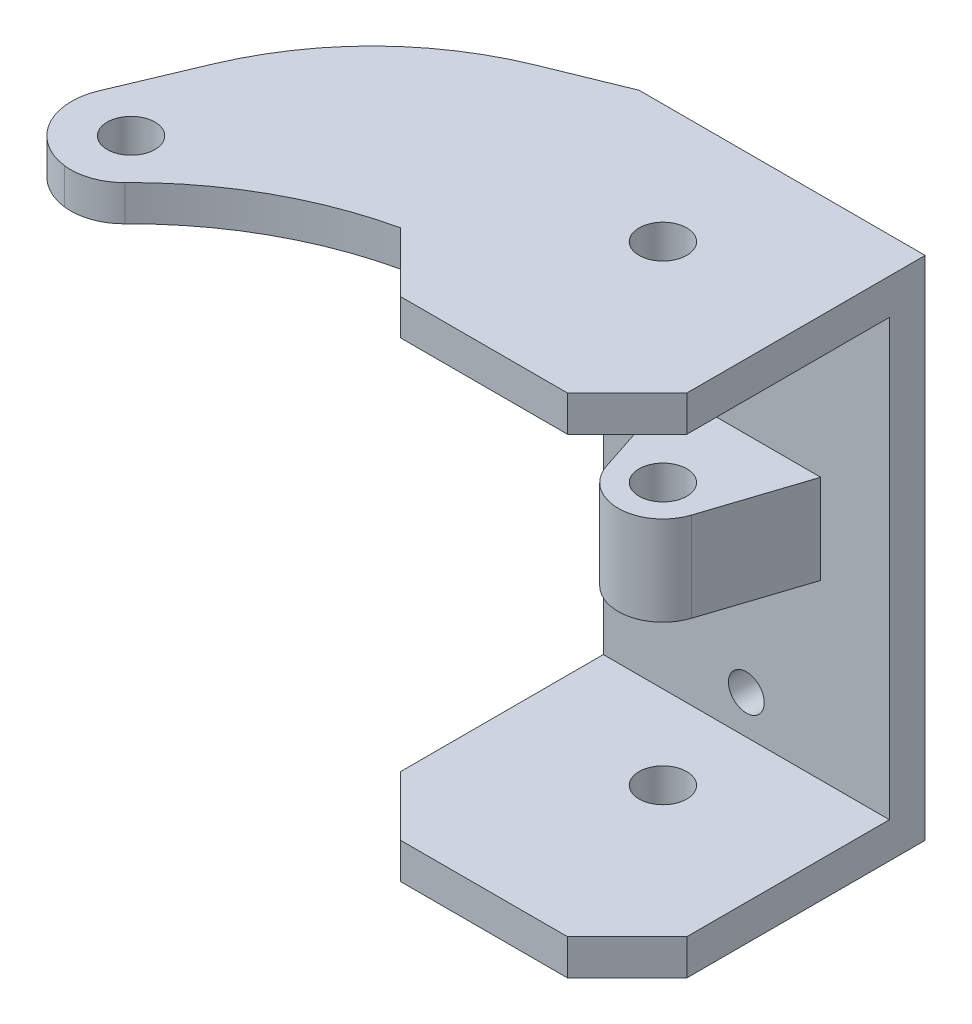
from build123d import *

# Parameters (mm, degrees)
IZIM1_W                     = 48
IZIM1_H                     = 85
Y_KSEKLIK_EKSTR_ZYON1_DEPTH = 6
IZIM2_R                     = 3
KES_EKSTR_ZYON1_DEPTH       = 6
IZIM4_W                     = 48
IZIM4_H                     = 6
Y_KSEKLIK_EKSTR_ZYON3_DEPTH = 44
PAH1_SIZE                   = 10
Y_KSEKLIK_EKSTR_ZYON4_DEPTH = 7.5
IZIM9_W                     = 4
IZIM9_H                     = 100
KES_EKSTR_ZYON2_START       = -96
IZIM10_R                    = 4
KES_EKSTR_ZYON2_DEPTH       = 96
IZIM11_R                    = 4
Y_KSEKLIK_EKSTR_ZYON5_DEPTH = 6
RADYUS1_R                   = 50
RADYUS2_R                   = 9


with BuildPart() as part:
    # izim1 → Y_kseklik-Ekstr_zyon1 (new body)
    with BuildSketch(Plane.XY):
        Rectangle(IZIM1_W, IZIM1_H)
    extrude(amount=Y_KSEKLIK_EKSTR_ZYON1_DEPTH)

    # izim2 → Kes-Ekstr_zyon1 (cut)
    with BuildSketch(Plane.XY.offset(6)):
        with Locations((0, 30)):
            Circle(IZIM2_R)
        with Locations((0, -30)):
            Circle(IZIM2_R)
    extrude(amount=-KES_EKSTR_ZYON1_DEPTH, mode=Mode.SUBTRACT)

    # izim4 → Y_kseklik-Ekstr_zyon3 (add)
    with BuildSketch(Plane.XY.offset(6)):
        with Locations((0, 39.5)):
            Rectangle(IZIM4_W, IZIM4_H)
        with Locations((0, -39.5)):
            Rectangle(IZIM4_W, IZIM4_H)
    extrude(amount=Y_KSEKLIK_EKSTR_ZYON3_DEPTH)

    # Pah1
    pah1_edges = [part.edges().sort_by_distance(p)[0] for p in [
        (-24, 39.5, 50),
        (24, 39.5, 50),
        (-24, -39.5, 50),
        (24, -39.5, 50),
    ]]
    chamfer(pah1_edges, length=PAH1_SIZE)

    # izim5 → Y_kseklik-Ekstr_zyon4 (add, symmetric)
    with BuildSketch(Plane(origin=(0, 0, 0), x_dir=(1, 0, 0), z_dir=(0, 1, 0))):
        with BuildLine():
            Line((14.425807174, 0), (0, 0))
            Line((0, 0), (-14.425807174, 0))
            Line((-14.425807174, 0), (-7.129023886, -22.329596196))
            ThreePointArc((-7.129023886, -22.329596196), (0, -27.5), (7.129023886, -22.329596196))
            Line((7.129023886, -22.329596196), (14.425807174, 0))
        make_face()
    extrude(amount=Y_KSEKLIK_EKSTR_ZYON4_DEPTH, both=True)

    # izim9 → Delik1 (revolve, cut)
    with BuildSketch(Plane(origin=(0, -7.5, 20), x_dir=(0, 0, -1), z_dir=(1, 0, 0))):
        with Locations((2, 50)):
            Rectangle(IZIM9_W, IZIM9_H)
    revolve(axis=Axis((0, 102.5, 20), (0, -1, 0)), mode=Mode.SUBTRACT)

    # izim10 → Kes-Ekstr_zyon2 (cut)
    with BuildSketch(Plane(origin=(0, 42.5, 0), x_dir=(1, 0, 0), z_dir=(0, 1, 0)).offset(KES_EKSTR_ZYON2_START)):
        with Locations(Location((0, -20, 0), (0, 0, 90))):
            Circle(IZIM10_R)
    extrude(amount=KES_EKSTR_ZYON2_DEPTH, mode=Mode.SUBTRACT)

    # izim11 → Y_kseklik-Ekstr_zyon5 (add)
    with BuildSketch(Plane(origin=(0, 42.5, 0), x_dir=(1, 0, 0), z_dir=(0, 1, 0))):
        with BuildLine():
            Line((-24, 0), (-55.514417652, -12.831107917))
            Line((-55.514417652, -12.831107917), (-69.217655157, -45.356248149))
            ThreePointArc((-69.217655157, -45.356248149), (-66.618304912, -56.737288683), (-55.00215705, -57.899103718))
            ThreePointArc((-55.00215705, -57.899103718), (-40.867086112, -46.583557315), (-24, -40))
            Line((-24, -40), (-24, 0))
        make_face()
        with Locations(Location((-60.00215705, -49.238849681, 0), (0, 0, 270))):
            Circle(IZIM11_R, mode=Mode.SUBTRACT)
    extrude(amount=-Y_KSEKLIK_EKSTR_ZYON5_DEPTH)

    # Radyus1
    radyus1_edges = [part.edges().sort_by_distance(p)[0] for p in [
        (-55.514417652, 39.5, 12.831107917),
    ]]
    fillet(radyus1_edges, radius=RADYUS1_R)

    # Radyus2
    radyus2_edges = [part.edges().sort_by_distance(p)[0] for p in [
        (-55.00215705, 39.5, 57.899103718),
    ]]
    fillet(radyus2_edges, radius=RADYUS2_R)


solid = part.part
